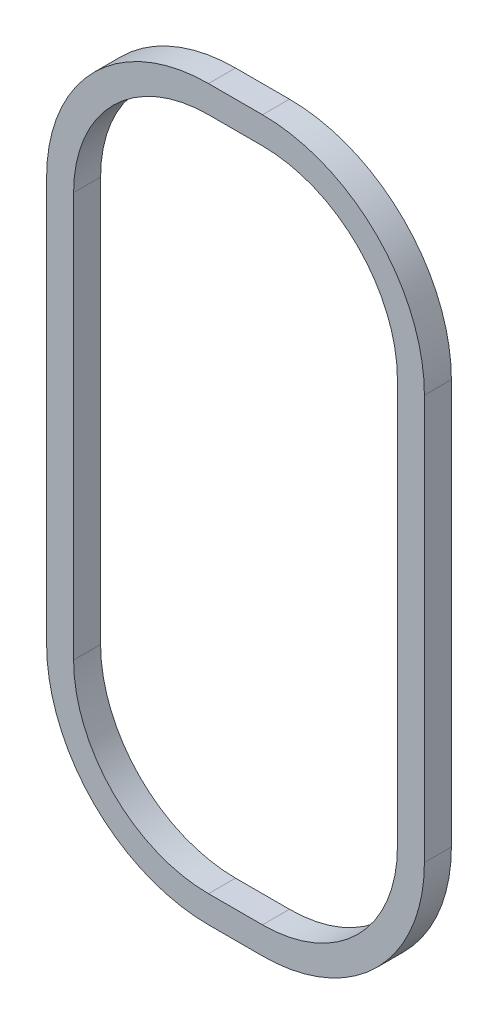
ISO-10303-21;
HEADER;
FILE_DESCRIPTION(('STEP AP214'),'2;1');
FILE_NAME('part.step','',(''),(''),'','','');
FILE_SCHEMA(('AUTOMOTIVE_DESIGN { 1 0 10303 214 1 1 1 1 }'));
ENDSEC;
DATA;
#1=APPLICATION_CONTEXT('core data for automotive mechanical design processes');
#2=APPLICATION_PROTOCOL_DEFINITION('international standard','automotive_design',2000,#1);
#3=PRODUCT_CONTEXT('',#1,'mechanical');
#4=PRODUCT('Part','Part','',(#3));
#5=PRODUCT_RELATED_PRODUCT_CATEGORY('part','',(#4));
#6=PRODUCT_DEFINITION_FORMATION('','',#4);
#7=PRODUCT_DEFINITION_CONTEXT('part definition',#1,'design');
#8=PRODUCT_DEFINITION('design','',#6,#7);
#9=PRODUCT_DEFINITION_SHAPE('','',#8);
#10=(LENGTH_UNIT() NAMED_UNIT(*) SI_UNIT(.MILLI.,.METRE.));
#11=(NAMED_UNIT(*) PLANE_ANGLE_UNIT() SI_UNIT($,.RADIAN.));
#12=(NAMED_UNIT(*) SI_UNIT($,.STERADIAN.) SOLID_ANGLE_UNIT());
#13=UNCERTAINTY_MEASURE_WITH_UNIT(LENGTH_MEASURE(1.E-05),#10,'distance_accuracy_value','');
#14=(GEOMETRIC_REPRESENTATION_CONTEXT(3) GLOBAL_UNCERTAINTY_ASSIGNED_CONTEXT((#13)) GLOBAL_UNIT_ASSIGNED_CONTEXT((#10,
#11,#12)) REPRESENTATION_CONTEXT('',''));
#15=CARTESIAN_POINT('',(0.,0.,0.));
#16=DIRECTION('',(0.,0.,1.));
#17=DIRECTION('',(1.,0.,0.));
#18=AXIS2_PLACEMENT_3D('',#15,#16,#17);
#19=CARTESIAN_POINT('',(5.,20.,1.));
#20=DIRECTION('',(0.,0.,-1.));
#21=DIRECTION('',(-1.,0.,0.));
#22=AXIS2_PLACEMENT_3D('',#19,#20,#21);
#23=PLANE('',#22);
#24=CARTESIAN_POINT('',(5.,20.,1.));
#25=DIRECTION('',(0.,0.,1.));
#26=DIRECTION('',(-1.,0.,0.));
#27=AXIS2_PLACEMENT_3D('',#24,#25,#26);
#28=CIRCLE('',#27,6.);
#29=CARTESIAN_POINT('',(5.00000000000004,26.,1.));
#30=VERTEX_POINT('',#29);
#31=CARTESIAN_POINT('',(-1.,20.,1.));
#32=VERTEX_POINT('',#31);
#33=EDGE_CURVE('E215',#30,#32,#28,.T.);
#34=ORIENTED_EDGE('',*,*,#33,.T.);
#35=DIRECTION('',(0.,-1.,0.));
#36=VECTOR('',#35,1.);
#37=CARTESIAN_POINT('',(-1.,5.00000000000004,1.));
#38=LINE('',#37,#36);
#39=CARTESIAN_POINT('',(-1.,5.00000000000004,1.));
#40=VERTEX_POINT('',#39);
#41=EDGE_CURVE('E218',#32,#40,#38,.T.);
#42=ORIENTED_EDGE('',*,*,#41,.T.);
#43=CARTESIAN_POINT('',(5.,5.,1.));
#44=DIRECTION('',(0.,0.,1.));
#45=DIRECTION('',(-1.,0.,0.));
#46=AXIS2_PLACEMENT_3D('',#43,#44,#45);
#47=CIRCLE('',#46,6.);
#48=CARTESIAN_POINT('',(5.00000000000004,-1.,1.));
#49=VERTEX_POINT('',#48);
#50=EDGE_CURVE('E221',#40,#49,#47,.T.);
#51=ORIENTED_EDGE('',*,*,#50,.T.);
#52=DIRECTION('',(1.,0.,0.));
#53=VECTOR('',#52,1.);
#54=CARTESIAN_POINT('',(5.00000000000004,-1.,1.));
#55=LINE('',#54,#53);
#56=CARTESIAN_POINT('',(7.,-1.,1.));
#57=VERTEX_POINT('',#56);
#58=EDGE_CURVE('E223',#49,#57,#55,.T.);
#59=ORIENTED_EDGE('',*,*,#58,.T.);
#60=CARTESIAN_POINT('',(7.,5.,1.));
#61=DIRECTION('',(0.,0.,1.));
#62=DIRECTION('',(1.,0.,0.));
#63=AXIS2_PLACEMENT_3D('',#60,#61,#62);
#64=CIRCLE('',#63,6.);
#65=CARTESIAN_POINT('',(13.,5.,1.));
#66=VERTEX_POINT('',#65);
#67=EDGE_CURVE('E225',#57,#66,#64,.T.);
#68=ORIENTED_EDGE('',*,*,#67,.T.);
#69=DIRECTION('',(0.,1.,0.));
#70=VECTOR('',#69,1.);
#71=CARTESIAN_POINT('',(13.,5.,1.));
#72=LINE('',#71,#70);
#73=CARTESIAN_POINT('',(13.,20.,1.));
#74=VERTEX_POINT('',#73);
#75=EDGE_CURVE('E227',#66,#74,#72,.T.);
#76=ORIENTED_EDGE('',*,*,#75,.T.);
#77=CARTESIAN_POINT('',(7.,20.,1.));
#78=DIRECTION('',(0.,0.,1.));
#79=DIRECTION('',(-1.,0.,0.));
#80=AXIS2_PLACEMENT_3D('',#77,#78,#79);
#81=CIRCLE('',#80,6.);
#82=CARTESIAN_POINT('',(7.,26.,1.));
#83=VERTEX_POINT('',#82);
#84=EDGE_CURVE('E229',#74,#83,#81,.T.);
#85=ORIENTED_EDGE('',*,*,#84,.T.);
#86=DIRECTION('',(-1.,0.,0.));
#87=VECTOR('',#86,1.);
#88=CARTESIAN_POINT('',(5.00000000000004,26.,1.));
#89=LINE('',#88,#87);
#90=EDGE_CURVE('E231',#83,#30,#89,.T.);
#91=ORIENTED_EDGE('',*,*,#90,.T.);
#92=EDGE_LOOP('',(#34,#42,#51,#59,#68,#76,#85,#91));
#93=FACE_BOUND('',#92,.T.);
#94=CARTESIAN_POINT('',(5.,5.,1.));
#95=DIRECTION('',(0.,0.,1.));
#96=DIRECTION('',(-1.,0.,0.));
#97=AXIS2_PLACEMENT_3D('',#94,#95,#96);
#98=CIRCLE('',#97,5.);
#99=CARTESIAN_POINT('',(0.,5.00000000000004,1.));
#100=VERTEX_POINT('',#99);
#101=CARTESIAN_POINT('',(5.00000000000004,0.,1.));
#102=VERTEX_POINT('',#101);
#103=EDGE_CURVE('E150',#100,#102,#98,.T.);
#104=ORIENTED_EDGE('',*,*,#103,.F.);
#105=DIRECTION('',(0.,-1.,0.));
#106=VECTOR('',#105,1.);
#107=CARTESIAN_POINT('',(0.,5.00000000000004,1.));
#108=LINE('',#107,#106);
#109=CARTESIAN_POINT('',(0.,20.,1.));
#110=VERTEX_POINT('',#109);
#111=EDGE_CURVE('E183',#110,#100,#108,.T.);
#112=ORIENTED_EDGE('',*,*,#111,.F.);
#113=CARTESIAN_POINT('',(5.,20.,1.));
#114=DIRECTION('',(0.,0.,1.));
#115=DIRECTION('',(-1.,0.,0.));
#116=AXIS2_PLACEMENT_3D('',#113,#114,#115);
#117=CIRCLE('',#116,5.);
#118=CARTESIAN_POINT('',(5.00000000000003,25.,1.));
#119=VERTEX_POINT('',#118);
#120=EDGE_CURVE('E181',#119,#110,#117,.T.);
#121=ORIENTED_EDGE('',*,*,#120,.F.);
#122=DIRECTION('',(-1.,0.,0.));
#123=VECTOR('',#122,1.);
#124=CARTESIAN_POINT('',(5.00000000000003,25.,1.));
#125=LINE('',#124,#123);
#126=CARTESIAN_POINT('',(7.,25.,1.));
#127=VERTEX_POINT('',#126);
#128=EDGE_CURVE('E179',#127,#119,#125,.T.);
#129=ORIENTED_EDGE('',*,*,#128,.F.);
#130=CARTESIAN_POINT('',(7.,20.,1.));
#131=DIRECTION('',(0.,0.,1.));
#132=DIRECTION('',(-1.,0.,0.));
#133=AXIS2_PLACEMENT_3D('',#130,#131,#132);
#134=CIRCLE('',#133,5.);
#135=CARTESIAN_POINT('',(12.,20.,1.));
#136=VERTEX_POINT('',#135);
#137=EDGE_CURVE('E177',#136,#127,#134,.T.);
#138=ORIENTED_EDGE('',*,*,#137,.F.);
#139=DIRECTION('',(0.,1.,0.));
#140=VECTOR('',#139,1.);
#141=CARTESIAN_POINT('',(12.,5.,1.));
#142=LINE('',#141,#140);
#143=CARTESIAN_POINT('',(12.,5.,1.));
#144=VERTEX_POINT('',#143);
#145=EDGE_CURVE('E173',#144,#136,#142,.T.);
#146=ORIENTED_EDGE('',*,*,#145,.F.);
#147=CARTESIAN_POINT('',(7.,5.,1.));
#148=DIRECTION('',(0.,0.,1.));
#149=DIRECTION('',(1.,0.,0.));
#150=AXIS2_PLACEMENT_3D('',#147,#148,#149);
#151=CIRCLE('',#150,5.);
#152=CARTESIAN_POINT('',(7.,0.,1.));
#153=VERTEX_POINT('',#152);
#154=EDGE_CURVE('E171',#153,#144,#151,.T.);
#155=ORIENTED_EDGE('',*,*,#154,.F.);
#156=DIRECTION('',(1.,0.,0.));
#157=VECTOR('',#156,1.);
#158=CARTESIAN_POINT('',(5.00000000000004,0.,1.));
#159=LINE('',#158,#157);
#160=EDGE_CURVE('E158',#102,#153,#159,.T.);
#161=ORIENTED_EDGE('',*,*,#160,.F.);
#162=EDGE_LOOP('',(#104,#112,#121,#129,#138,#146,#155,#161));
#163=FACE_BOUND('',#162,.T.);
#164=ADVANCED_FACE('F37',(#93,#163),#23,.F.);
#165=CARTESIAN_POINT('',(5.,20.,0.));
#166=DIRECTION('',(0.,0.,-1.));
#167=DIRECTION('',(-1.,0.,0.));
#168=AXIS2_PLACEMENT_3D('',#165,#166,#167);
#169=PLANE('',#168);
#170=CARTESIAN_POINT('',(5.,20.,0.));
#171=DIRECTION('',(0.,0.,1.));
#172=DIRECTION('',(-1.,0.,0.));
#173=AXIS2_PLACEMENT_3D('',#170,#171,#172);
#174=CIRCLE('',#173,6.);
#175=CARTESIAN_POINT('',(5.00000000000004,26.,0.));
#176=VERTEX_POINT('',#175);
#177=CARTESIAN_POINT('',(-1.,20.,0.));
#178=VERTEX_POINT('',#177);
#179=EDGE_CURVE('E166',#176,#178,#174,.T.);
#180=ORIENTED_EDGE('',*,*,#179,.F.);
#181=DIRECTION('',(-1.,0.,0.));
#182=VECTOR('',#181,1.);
#183=CARTESIAN_POINT('',(5.00000000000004,26.,0.));
#184=LINE('',#183,#182);
#185=CARTESIAN_POINT('',(7.,26.,0.));
#186=VERTEX_POINT('',#185);
#187=EDGE_CURVE('E219',#186,#176,#184,.T.);
#188=ORIENTED_EDGE('',*,*,#187,.F.);
#189=CARTESIAN_POINT('',(7.,20.,0.));
#190=DIRECTION('',(0.,0.,1.));
#191=DIRECTION('',(-1.,0.,0.));
#192=AXIS2_PLACEMENT_3D('',#189,#190,#191);
#193=CIRCLE('',#192,6.);
#194=CARTESIAN_POINT('',(13.,20.,0.));
#195=VERTEX_POINT('',#194);
#196=EDGE_CURVE('E246',#195,#186,#193,.T.);
#197=ORIENTED_EDGE('',*,*,#196,.F.);
#198=DIRECTION('',(0.,1.,0.));
#199=VECTOR('',#198,1.);
#200=CARTESIAN_POINT('',(13.,5.,0.));
#201=LINE('',#200,#199);
#202=CARTESIAN_POINT('',(13.,5.,0.));
#203=VERTEX_POINT('',#202);
#204=EDGE_CURVE('E244',#203,#195,#201,.T.);
#205=ORIENTED_EDGE('',*,*,#204,.F.);
#206=CARTESIAN_POINT('',(7.,5.,0.));
#207=DIRECTION('',(0.,0.,1.));
#208=DIRECTION('',(1.,0.,0.));
#209=AXIS2_PLACEMENT_3D('',#206,#207,#208);
#210=CIRCLE('',#209,6.);
#211=CARTESIAN_POINT('',(7.,-1.,0.));
#212=VERTEX_POINT('',#211);
#213=EDGE_CURVE('E242',#212,#203,#210,.T.);
#214=ORIENTED_EDGE('',*,*,#213,.F.);
#215=DIRECTION('',(1.,0.,0.));
#216=VECTOR('',#215,1.);
#217=CARTESIAN_POINT('',(5.00000000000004,-1.,0.));
#218=LINE('',#217,#216);
#219=CARTESIAN_POINT('',(5.00000000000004,-1.,0.));
#220=VERTEX_POINT('',#219);
#221=EDGE_CURVE('E240',#220,#212,#218,.T.);
#222=ORIENTED_EDGE('',*,*,#221,.F.);
#223=CARTESIAN_POINT('',(5.,5.,0.));
#224=DIRECTION('',(0.,0.,1.));
#225=DIRECTION('',(-1.,0.,0.));
#226=AXIS2_PLACEMENT_3D('',#223,#224,#225);
#227=CIRCLE('',#226,6.);
#228=CARTESIAN_POINT('',(-1.,5.00000000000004,0.));
#229=VERTEX_POINT('',#228);
#230=EDGE_CURVE('E238',#229,#220,#227,.T.);
#231=ORIENTED_EDGE('',*,*,#230,.F.);
#232=DIRECTION('',(0.,-1.,0.));
#233=VECTOR('',#232,1.);
#234=CARTESIAN_POINT('',(-1.,5.00000000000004,0.));
#235=LINE('',#234,#233);
#236=EDGE_CURVE('E236',#178,#229,#235,.T.);
#237=ORIENTED_EDGE('',*,*,#236,.F.);
#238=EDGE_LOOP('',(#180,#188,#197,#205,#214,#222,#231,#237));
#239=FACE_BOUND('',#238,.T.);
#240=DIRECTION('',(0.,-1.,0.));
#241=VECTOR('',#240,1.);
#242=CARTESIAN_POINT('',(0.,5.00000000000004,0.));
#243=LINE('',#242,#241);
#244=CARTESIAN_POINT('',(0.,20.,0.));
#245=VERTEX_POINT('',#244);
#246=CARTESIAN_POINT('',(0.,5.00000000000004,0.));
#247=VERTEX_POINT('',#246);
#248=EDGE_CURVE('E159',#245,#247,#243,.T.);
#249=ORIENTED_EDGE('',*,*,#248,.T.);
#250=CARTESIAN_POINT('',(5.,5.,0.));
#251=DIRECTION('',(0.,0.,1.));
#252=DIRECTION('',(-1.,0.,0.));
#253=AXIS2_PLACEMENT_3D('',#250,#251,#252);
#254=CIRCLE('',#253,5.);
#255=CARTESIAN_POINT('',(5.00000000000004,0.,0.));
#256=VERTEX_POINT('',#255);
#257=EDGE_CURVE('E60',#247,#256,#254,.T.);
#258=ORIENTED_EDGE('',*,*,#257,.T.);
#259=DIRECTION('',(1.,0.,0.));
#260=VECTOR('',#259,1.);
#261=CARTESIAN_POINT('',(5.00000000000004,0.,0.));
#262=LINE('',#261,#260);
#263=CARTESIAN_POINT('',(7.,0.,0.));
#264=VERTEX_POINT('',#263);
#265=EDGE_CURVE('E165',#256,#264,#262,.T.);
#266=ORIENTED_EDGE('',*,*,#265,.T.);
#267=CARTESIAN_POINT('',(7.,5.,0.));
#268=DIRECTION('',(0.,0.,1.));
#269=DIRECTION('',(1.,0.,0.));
#270=AXIS2_PLACEMENT_3D('',#267,#268,#269);
#271=CIRCLE('',#270,5.);
#272=CARTESIAN_POINT('',(12.,5.,0.));
#273=VERTEX_POINT('',#272);
#274=EDGE_CURVE('E187',#264,#273,#271,.T.);
#275=ORIENTED_EDGE('',*,*,#274,.T.);
#276=DIRECTION('',(0.,1.,0.));
#277=VECTOR('',#276,1.);
#278=CARTESIAN_POINT('',(12.,5.,0.));
#279=LINE('',#278,#277);
#280=CARTESIAN_POINT('',(12.,20.,0.));
#281=VERTEX_POINT('',#280);
#282=EDGE_CURVE('E190',#273,#281,#279,.T.);
#283=ORIENTED_EDGE('',*,*,#282,.T.);
#284=CARTESIAN_POINT('',(7.,20.,0.));
#285=DIRECTION('',(0.,0.,1.));
#286=DIRECTION('',(-1.,0.,0.));
#287=AXIS2_PLACEMENT_3D('',#284,#285,#286);
#288=CIRCLE('',#287,5.);
#289=CARTESIAN_POINT('',(7.,25.,0.));
#290=VERTEX_POINT('',#289);
#291=EDGE_CURVE('E193',#281,#290,#288,.T.);
#292=ORIENTED_EDGE('',*,*,#291,.T.);
#293=DIRECTION('',(-1.,0.,0.));
#294=VECTOR('',#293,1.);
#295=CARTESIAN_POINT('',(5.00000000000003,25.,0.));
#296=LINE('',#295,#294);
#297=CARTESIAN_POINT('',(5.00000000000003,25.,0.));
#298=VERTEX_POINT('',#297);
#299=EDGE_CURVE('E196',#290,#298,#296,.T.);
#300=ORIENTED_EDGE('',*,*,#299,.T.);
#301=CARTESIAN_POINT('',(5.,20.,0.));
#302=DIRECTION('',(0.,0.,1.));
#303=DIRECTION('',(-1.,0.,0.));
#304=AXIS2_PLACEMENT_3D('',#301,#302,#303);
#305=CIRCLE('',#304,5.);
#306=EDGE_CURVE('E199',#298,#245,#305,.T.);
#307=ORIENTED_EDGE('',*,*,#306,.T.);
#308=EDGE_LOOP('',(#249,#258,#266,#275,#283,#292,#300,#307));
#309=FACE_BOUND('',#308,.T.);
#310=ADVANCED_FACE('F276',(#239,#309),#169,.T.);
#311=CARTESIAN_POINT('',(5.,20.,1.));
#312=DIRECTION('',(0.,0.,-1.));
#313=DIRECTION('',(-1.,0.,0.));
#314=AXIS2_PLACEMENT_3D('',#311,#312,#313);
#315=CYLINDRICAL_SURFACE('',#314,6.);
#316=ORIENTED_EDGE('',*,*,#179,.T.);
#317=DIRECTION('',(0.,0.,-1.));
#318=VECTOR('',#317,1.);
#319=CARTESIAN_POINT('',(-1.,20.,1.));
#320=LINE('',#319,#318);
#321=EDGE_CURVE('E11',#32,#178,#320,.T.);
#322=ORIENTED_EDGE('',*,*,#321,.F.);
#323=ORIENTED_EDGE('',*,*,#33,.F.);
#324=DIRECTION('',(0.,0.,-1.));
#325=VECTOR('',#324,1.);
#326=CARTESIAN_POINT('',(5.00000000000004,26.,1.));
#327=LINE('',#326,#325);
#328=EDGE_CURVE('E233',#30,#176,#327,.T.);
#329=ORIENTED_EDGE('',*,*,#328,.T.);
#330=EDGE_LOOP('',(#316,#322,#323,#329));
#331=FACE_BOUND('',#330,.T.);
#332=ADVANCED_FACE('F39',(#331),#315,.T.);
#333=CARTESIAN_POINT('',(-1.,5.00000000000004,1.));
#334=DIRECTION('',(1.,0.,0.));
#335=DIRECTION('',(0.,1.,0.));
#336=AXIS2_PLACEMENT_3D('',#333,#334,#335);
#337=PLANE('',#336);
#338=ORIENTED_EDGE('',*,*,#236,.T.);
#339=DIRECTION('',(0.,0.,-1.));
#340=VECTOR('',#339,1.);
#341=CARTESIAN_POINT('',(-1.,5.00000000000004,1.));
#342=LINE('',#341,#340);
#343=EDGE_CURVE('E45',#40,#229,#342,.T.);
#344=ORIENTED_EDGE('',*,*,#343,.F.);
#345=ORIENTED_EDGE('',*,*,#41,.F.);
#346=ORIENTED_EDGE('',*,*,#321,.T.);
#347=EDGE_LOOP('',(#338,#344,#345,#346));
#348=FACE_BOUND('',#347,.T.);
#349=ADVANCED_FACE('F293',(#348),#337,.F.);
#350=CARTESIAN_POINT('',(5.,5.,1.));
#351=DIRECTION('',(0.,0.,-1.));
#352=DIRECTION('',(-1.,0.,0.));
#353=AXIS2_PLACEMENT_3D('',#350,#351,#352);
#354=CYLINDRICAL_SURFACE('',#353,6.);
#355=ORIENTED_EDGE('',*,*,#230,.T.);
#356=DIRECTION('',(0.,0.,-1.));
#357=VECTOR('',#356,1.);
#358=CARTESIAN_POINT('',(5.00000000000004,-1.,1.));
#359=LINE('',#358,#357);
#360=EDGE_CURVE('E263',#49,#220,#359,.T.);
#361=ORIENTED_EDGE('',*,*,#360,.F.);
#362=ORIENTED_EDGE('',*,*,#50,.F.);
#363=ORIENTED_EDGE('',*,*,#343,.T.);
#364=EDGE_LOOP('',(#355,#361,#362,#363));
#365=FACE_BOUND('',#364,.T.);
#366=ADVANCED_FACE('F270',(#365),#354,.T.);
#367=CARTESIAN_POINT('',(5.00000000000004,-1.,1.));
#368=DIRECTION('',(0.,1.,0.));
#369=DIRECTION('',(-1.,0.,0.));
#370=AXIS2_PLACEMENT_3D('',#367,#368,#369);
#371=PLANE('',#370);
#372=ORIENTED_EDGE('',*,*,#221,.T.);
#373=DIRECTION('',(0.,0.,-1.));
#374=VECTOR('',#373,1.);
#375=CARTESIAN_POINT('',(7.,-1.,1.));
#376=LINE('',#375,#374);
#377=EDGE_CURVE('E260',#57,#212,#376,.T.);
#378=ORIENTED_EDGE('',*,*,#377,.F.);
#379=ORIENTED_EDGE('',*,*,#58,.F.);
#380=ORIENTED_EDGE('',*,*,#360,.T.);
#381=EDGE_LOOP('',(#372,#378,#379,#380));
#382=FACE_BOUND('',#381,.T.);
#383=ADVANCED_FACE('F282',(#382),#371,.F.);
#384=CARTESIAN_POINT('',(7.,5.,1.));
#385=DIRECTION('',(0.,0.,-1.));
#386=DIRECTION('',(-1.,0.,0.));
#387=AXIS2_PLACEMENT_3D('',#384,#385,#386);
#388=CYLINDRICAL_SURFACE('',#387,6.);
#389=ORIENTED_EDGE('',*,*,#213,.T.);
#390=DIRECTION('',(0.,0.,-1.));
#391=VECTOR('',#390,1.);
#392=CARTESIAN_POINT('',(13.,5.,1.));
#393=LINE('',#392,#391);
#394=EDGE_CURVE('E257',#66,#203,#393,.T.);
#395=ORIENTED_EDGE('',*,*,#394,.F.);
#396=ORIENTED_EDGE('',*,*,#67,.F.);
#397=ORIENTED_EDGE('',*,*,#377,.T.);
#398=EDGE_LOOP('',(#389,#395,#396,#397));
#399=FACE_BOUND('',#398,.T.);
#400=ADVANCED_FACE('F286',(#399),#388,.T.);
#401=CARTESIAN_POINT('',(13.,5.,1.));
#402=DIRECTION('',(-1.,0.,0.));
#403=DIRECTION('',(0.,0.,1.));
#404=AXIS2_PLACEMENT_3D('',#401,#402,#403);
#405=PLANE('',#404);
#406=ORIENTED_EDGE('',*,*,#204,.T.);
#407=DIRECTION('',(0.,0.,-1.));
#408=VECTOR('',#407,1.);
#409=CARTESIAN_POINT('',(13.,20.,1.));
#410=LINE('',#409,#408);
#411=EDGE_CURVE('E254',#74,#195,#410,.T.);
#412=ORIENTED_EDGE('',*,*,#411,.F.);
#413=ORIENTED_EDGE('',*,*,#75,.F.);
#414=ORIENTED_EDGE('',*,*,#394,.T.);
#415=EDGE_LOOP('',(#406,#412,#413,#414));
#416=FACE_BOUND('',#415,.T.);
#417=ADVANCED_FACE('F306',(#416),#405,.F.);
#418=CARTESIAN_POINT('',(7.,20.,1.));
#419=DIRECTION('',(0.,0.,-1.));
#420=DIRECTION('',(-1.,0.,0.));
#421=AXIS2_PLACEMENT_3D('',#418,#419,#420);
#422=CYLINDRICAL_SURFACE('',#421,6.);
#423=ORIENTED_EDGE('',*,*,#196,.T.);
#424=DIRECTION('',(0.,0.,-1.));
#425=VECTOR('',#424,1.);
#426=CARTESIAN_POINT('',(7.,26.,1.));
#427=LINE('',#426,#425);
#428=EDGE_CURVE('E251',#83,#186,#427,.T.);
#429=ORIENTED_EDGE('',*,*,#428,.F.);
#430=ORIENTED_EDGE('',*,*,#84,.F.);
#431=ORIENTED_EDGE('',*,*,#411,.T.);
#432=EDGE_LOOP('',(#423,#429,#430,#431));
#433=FACE_BOUND('',#432,.T.);
#434=ADVANCED_FACE('F304',(#433),#422,.T.);
#435=CARTESIAN_POINT('',(5.00000000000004,26.,1.));
#436=DIRECTION('',(0.,-1.,0.));
#437=DIRECTION('',(0.,0.,-1.));
#438=AXIS2_PLACEMENT_3D('',#435,#436,#437);
#439=PLANE('',#438);
#440=ORIENTED_EDGE('',*,*,#187,.T.);
#441=ORIENTED_EDGE('',*,*,#328,.F.);
#442=ORIENTED_EDGE('',*,*,#90,.F.);
#443=ORIENTED_EDGE('',*,*,#428,.T.);
#444=EDGE_LOOP('',(#440,#441,#442,#443));
#445=FACE_BOUND('',#444,.T.);
#446=ADVANCED_FACE('F299',(#445),#439,.F.);
#447=CARTESIAN_POINT('',(5.,5.,1.));
#448=DIRECTION('',(0.,0.,-1.));
#449=DIRECTION('',(-1.,0.,0.));
#450=AXIS2_PLACEMENT_3D('',#447,#448,#449);
#451=CYLINDRICAL_SURFACE('',#450,5.);
#452=ORIENTED_EDGE('',*,*,#257,.F.);
#453=DIRECTION('',(0.,0.,-1.));
#454=VECTOR('',#453,1.);
#455=CARTESIAN_POINT('',(0.,5.00000000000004,1.));
#456=LINE('',#455,#454);
#457=EDGE_CURVE('E154',#100,#247,#456,.T.);
#458=ORIENTED_EDGE('',*,*,#457,.F.);
#459=ORIENTED_EDGE('',*,*,#103,.T.);
#460=DIRECTION('',(0.,0.,-1.));
#461=VECTOR('',#460,1.);
#462=CARTESIAN_POINT('',(5.00000000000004,0.,1.));
#463=LINE('',#462,#461);
#464=EDGE_CURVE('E153',#102,#256,#463,.T.);
#465=ORIENTED_EDGE('',*,*,#464,.T.);
#466=EDGE_LOOP('',(#452,#458,#459,#465));
#467=FACE_BOUND('',#466,.T.);
#468=ADVANCED_FACE('F152',(#467),#451,.F.);
#469=CARTESIAN_POINT('',(5.00000000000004,0.,1.));
#470=DIRECTION('',(0.,1.,0.));
#471=DIRECTION('',(0.,0.,1.));
#472=AXIS2_PLACEMENT_3D('',#469,#470,#471);
#473=PLANE('',#472);
#474=ORIENTED_EDGE('',*,*,#265,.F.);
#475=ORIENTED_EDGE('',*,*,#464,.F.);
#476=ORIENTED_EDGE('',*,*,#160,.T.);
#477=DIRECTION('',(0.,0.,-1.));
#478=VECTOR('',#477,1.);
#479=CARTESIAN_POINT('',(7.,0.,1.));
#480=LINE('',#479,#478);
#481=EDGE_CURVE('E167',#153,#264,#480,.T.);
#482=ORIENTED_EDGE('',*,*,#481,.T.);
#483=EDGE_LOOP('',(#474,#475,#476,#482));
#484=FACE_BOUND('',#483,.T.);
#485=ADVANCED_FACE('F162',(#484),#473,.T.);
#486=CARTESIAN_POINT('',(7.,5.,1.));
#487=DIRECTION('',(0.,0.,-1.));
#488=DIRECTION('',(-1.,0.,0.));
#489=AXIS2_PLACEMENT_3D('',#486,#487,#488);
#490=CYLINDRICAL_SURFACE('',#489,5.);
#491=ORIENTED_EDGE('',*,*,#274,.F.);
#492=ORIENTED_EDGE('',*,*,#481,.F.);
#493=ORIENTED_EDGE('',*,*,#154,.T.);
#494=DIRECTION('',(0.,0.,-1.));
#495=VECTOR('',#494,1.);
#496=CARTESIAN_POINT('',(12.,5.,1.));
#497=LINE('',#496,#495);
#498=EDGE_CURVE('E212',#144,#273,#497,.T.);
#499=ORIENTED_EDGE('',*,*,#498,.T.);
#500=EDGE_LOOP('',(#491,#492,#493,#499));
#501=FACE_BOUND('',#500,.T.);
#502=ADVANCED_FACE('F331',(#501),#490,.F.);
#503=CARTESIAN_POINT('',(12.,5.,1.));
#504=DIRECTION('',(-1.,0.,0.));
#505=DIRECTION('',(0.,0.,1.));
#506=AXIS2_PLACEMENT_3D('',#503,#504,#505);
#507=PLANE('',#506);
#508=ORIENTED_EDGE('',*,*,#282,.F.);
#509=ORIENTED_EDGE('',*,*,#498,.F.);
#510=ORIENTED_EDGE('',*,*,#145,.T.);
#511=DIRECTION('',(0.,0.,-1.));
#512=VECTOR('',#511,1.);
#513=CARTESIAN_POINT('',(12.,20.,1.));
#514=LINE('',#513,#512);
#515=EDGE_CURVE('E210',#136,#281,#514,.T.);
#516=ORIENTED_EDGE('',*,*,#515,.T.);
#517=EDGE_LOOP('',(#508,#509,#510,#516));
#518=FACE_BOUND('',#517,.T.);
#519=ADVANCED_FACE('F335',(#518),#507,.T.);
#520=CARTESIAN_POINT('',(7.,20.,1.));
#521=DIRECTION('',(0.,0.,-1.));
#522=DIRECTION('',(-1.,0.,0.));
#523=AXIS2_PLACEMENT_3D('',#520,#521,#522);
#524=CYLINDRICAL_SURFACE('',#523,5.);
#525=ORIENTED_EDGE('',*,*,#291,.F.);
#526=ORIENTED_EDGE('',*,*,#515,.F.);
#527=ORIENTED_EDGE('',*,*,#137,.T.);
#528=DIRECTION('',(0.,0.,-1.));
#529=VECTOR('',#528,1.);
#530=CARTESIAN_POINT('',(7.,25.,1.));
#531=LINE('',#530,#529);
#532=EDGE_CURVE('E208',#127,#290,#531,.T.);
#533=ORIENTED_EDGE('',*,*,#532,.T.);
#534=EDGE_LOOP('',(#525,#526,#527,#533));
#535=FACE_BOUND('',#534,.T.);
#536=ADVANCED_FACE('F341',(#535),#524,.F.);
#537=CARTESIAN_POINT('',(5.00000000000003,25.,1.));
#538=DIRECTION('',(0.,-1.,0.));
#539=DIRECTION('',(0.,0.,-1.));
#540=AXIS2_PLACEMENT_3D('',#537,#538,#539);
#541=PLANE('',#540);
#542=ORIENTED_EDGE('',*,*,#299,.F.);
#543=ORIENTED_EDGE('',*,*,#532,.F.);
#544=ORIENTED_EDGE('',*,*,#128,.T.);
#545=DIRECTION('',(0.,0.,-1.));
#546=VECTOR('',#545,1.);
#547=CARTESIAN_POINT('',(5.00000000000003,25.,1.));
#548=LINE('',#547,#546);
#549=EDGE_CURVE('E206',#119,#298,#548,.T.);
#550=ORIENTED_EDGE('',*,*,#549,.T.);
#551=EDGE_LOOP('',(#542,#543,#544,#550));
#552=FACE_BOUND('',#551,.T.);
#553=ADVANCED_FACE('F345',(#552),#541,.T.);
#554=CARTESIAN_POINT('',(5.,20.,1.));
#555=DIRECTION('',(0.,0.,-1.));
#556=DIRECTION('',(-1.,0.,0.));
#557=AXIS2_PLACEMENT_3D('',#554,#555,#556);
#558=CYLINDRICAL_SURFACE('',#557,5.);
#559=ORIENTED_EDGE('',*,*,#306,.F.);
#560=ORIENTED_EDGE('',*,*,#549,.F.);
#561=ORIENTED_EDGE('',*,*,#120,.T.);
#562=DIRECTION('',(0.,0.,-1.));
#563=VECTOR('',#562,1.);
#564=CARTESIAN_POINT('',(0.,20.,1.));
#565=LINE('',#564,#563);
#566=EDGE_CURVE('E52',#110,#245,#565,.T.);
#567=ORIENTED_EDGE('',*,*,#566,.T.);
#568=EDGE_LOOP('',(#559,#560,#561,#567));
#569=FACE_BOUND('',#568,.T.);
#570=ADVANCED_FACE('F349',(#569),#558,.F.);
#571=CARTESIAN_POINT('',(0.,5.00000000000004,1.));
#572=DIRECTION('',(1.,0.,0.));
#573=DIRECTION('',(0.,0.,-1.));
#574=AXIS2_PLACEMENT_3D('',#571,#572,#573);
#575=PLANE('',#574);
#576=ORIENTED_EDGE('',*,*,#248,.F.);
#577=ORIENTED_EDGE('',*,*,#566,.F.);
#578=ORIENTED_EDGE('',*,*,#111,.T.);
#579=ORIENTED_EDGE('',*,*,#457,.T.);
#580=EDGE_LOOP('',(#576,#577,#578,#579));
#581=FACE_BOUND('',#580,.T.);
#582=ADVANCED_FACE('F353',(#581),#575,.T.);
#583=CLOSED_SHELL('',(#164,#310,#332,#349,#366,#383,#400,#417,#434,#446,#468,#485,#502,#519,
#536,#553,#570,#582));
#584=MANIFOLD_SOLID_BREP('B2',#583);
#585=ADVANCED_BREP_SHAPE_REPRESENTATION('',(#18,#584),#14);
#586=SHAPE_DEFINITION_REPRESENTATION(#9,#585);
ENDSEC;
END-ISO-10303-21;
